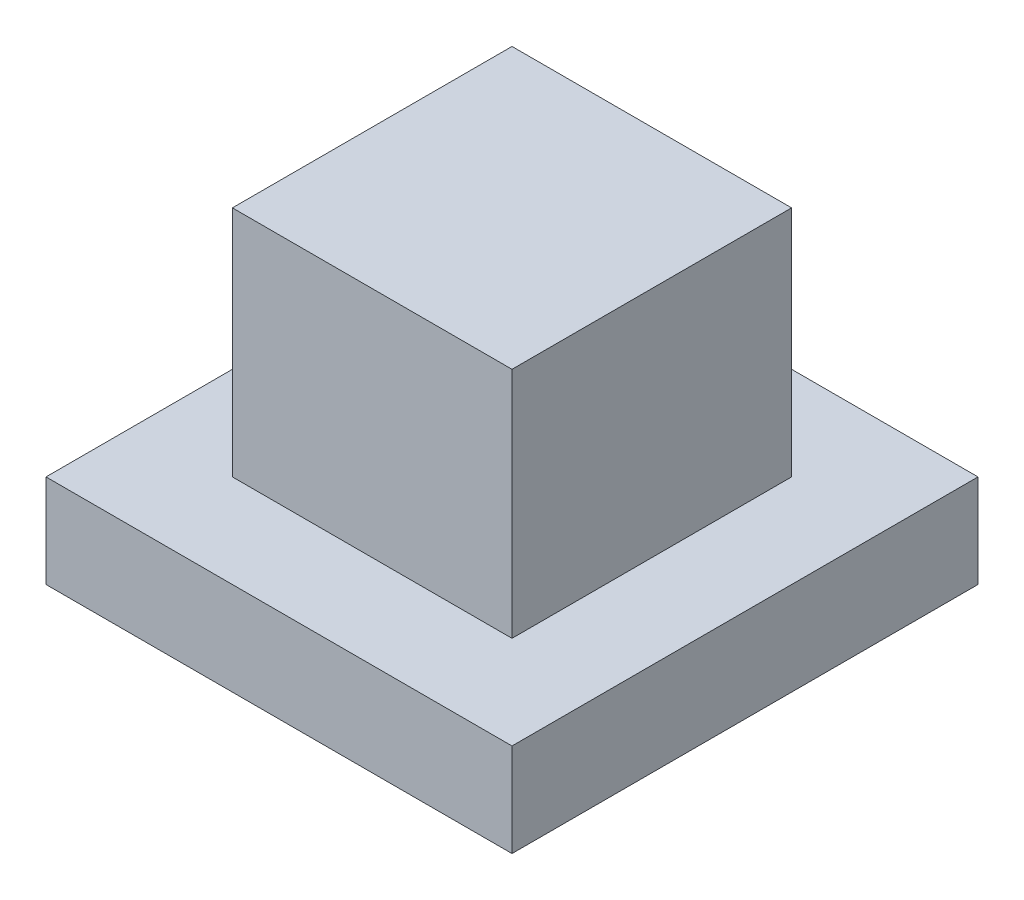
from build123d import *

# Parameters (mm, degrees)
SKETCH1_W           = 100
SKETCH1_H           = 20
BOSS_EXTRUDE1_DEPTH = 50
SKETCH2_W           = 60
SKETCH2_H           = 60
BOSS_EXTRUDE2_DEPTH = 50


with BuildPart() as part:
    # Sketch1 → Boss-Extrude1 (new, symmetric)
    with BuildSketch(Plane.XY):
        Rectangle(SKETCH1_W, SKETCH1_H)
    extrude(amount=BOSS_EXTRUDE1_DEPTH, both=True)

    # Sketch2 → Boss-Extrude2 (add)
    with BuildSketch(Plane(origin=(0, 10, 0), x_dir=(1, 0, 0), z_dir=(0, 1, 0))):
        Rectangle(SKETCH2_W, SKETCH2_H)
    extrude(amount=BOSS_EXTRUDE2_DEPTH)


solid = part.part
